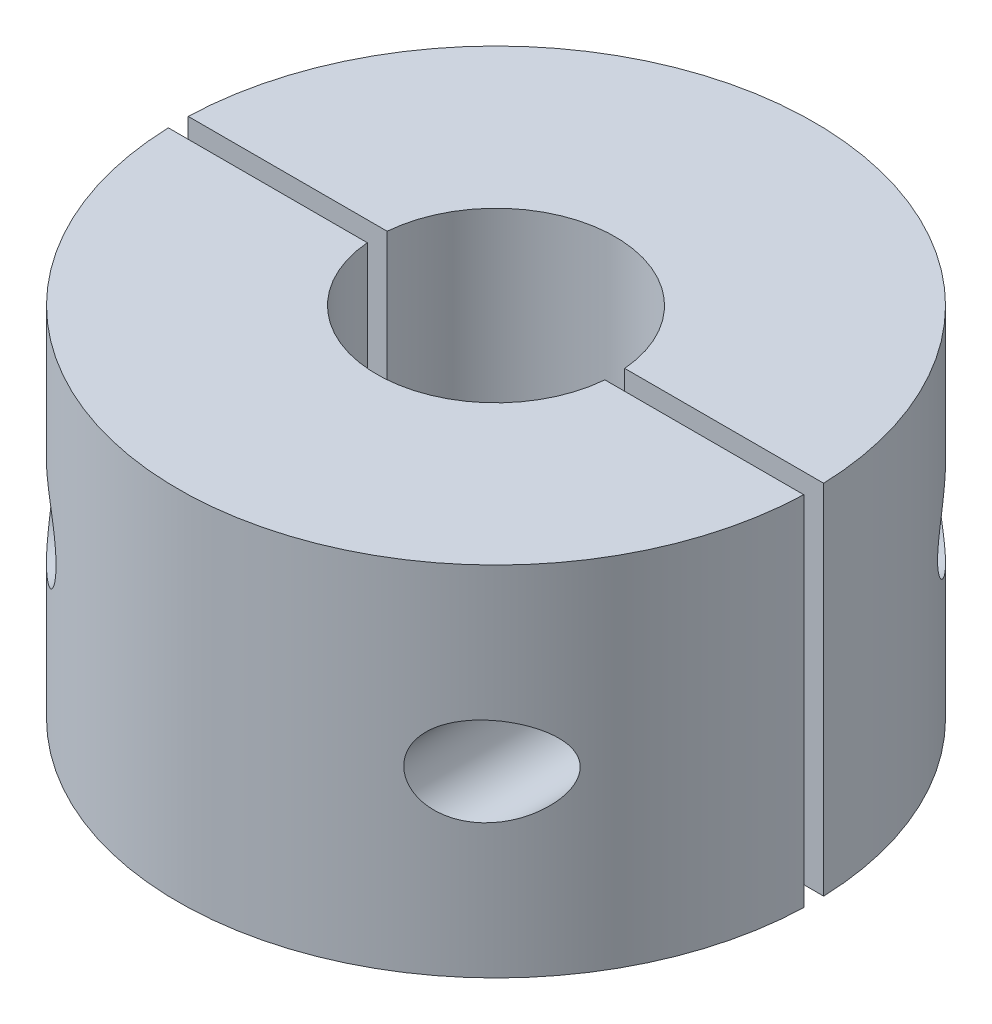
ISO-10303-21;
HEADER;
FILE_DESCRIPTION(('STEP AP214'),'2;1');
FILE_NAME('part.step','',(''),(''),'','','');
FILE_SCHEMA(('AUTOMOTIVE_DESIGN { 1 0 10303 214 1 1 1 1 }'));
ENDSEC;
DATA;
#1=APPLICATION_CONTEXT('core data for automotive mechanical design processes');
#2=APPLICATION_PROTOCOL_DEFINITION('international standard','automotive_design',2000,#1);
#3=PRODUCT_CONTEXT('',#1,'mechanical');
#4=PRODUCT('Part','Part','',(#3));
#5=PRODUCT_RELATED_PRODUCT_CATEGORY('part','',(#4));
#6=PRODUCT_DEFINITION_FORMATION('','',#4);
#7=PRODUCT_DEFINITION_CONTEXT('part definition',#1,'design');
#8=PRODUCT_DEFINITION('design','',#6,#7);
#9=PRODUCT_DEFINITION_SHAPE('','',#8);
#10=(LENGTH_UNIT() NAMED_UNIT(*) SI_UNIT(.MILLI.,.METRE.));
#11=(NAMED_UNIT(*) PLANE_ANGLE_UNIT() SI_UNIT($,.RADIAN.));
#12=(NAMED_UNIT(*) SI_UNIT($,.STERADIAN.) SOLID_ANGLE_UNIT());
#13=UNCERTAINTY_MEASURE_WITH_UNIT(LENGTH_MEASURE(1.E-05),#10,'distance_accuracy_value','');
#14=(GEOMETRIC_REPRESENTATION_CONTEXT(3) GLOBAL_UNCERTAINTY_ASSIGNED_CONTEXT((#13)) GLOBAL_UNIT_ASSIGNED_CONTEXT((#10,
#11,#12)) REPRESENTATION_CONTEXT('',''));
#15=CARTESIAN_POINT('',(0.,0.,0.));
#16=DIRECTION('',(0.,0.,1.));
#17=DIRECTION('',(1.,0.,0.));
#18=AXIS2_PLACEMENT_3D('',#15,#16,#17);
#19=CARTESIAN_POINT('',(0.,9.,0.));
#20=DIRECTION('',(0.,1.,0.));
#21=DIRECTION('',(0.,0.,1.));
#22=AXIS2_PLACEMENT_3D('',#19,#20,#21);
#23=PLANE('',#22);
#24=DIRECTION('',(-1.,0.,0.));
#25=VECTOR('',#24,1.);
#26=CARTESIAN_POINT('',(-10.,9.,-0.25));
#27=LINE('',#26,#25);
#28=CARTESIAN_POINT('',(7.99609279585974,9.,-0.25));
#29=VERTEX_POINT('',#28);
#30=CARTESIAN_POINT('',(2.98956518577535,9.,-0.25));
#31=VERTEX_POINT('',#30);
#32=EDGE_CURVE('E58',#29,#31,#27,.T.);
#33=ORIENTED_EDGE('',*,*,#32,.F.);
#34=CARTESIAN_POINT('',(0.,9.,0.));
#35=DIRECTION('',(0.,1.,0.));
#36=DIRECTION('',(0.,0.,1.));
#37=AXIS2_PLACEMENT_3D('',#34,#35,#36);
#38=CIRCLE('',#37,8.);
#39=CARTESIAN_POINT('',(-7.99609279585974,9.,-0.25));
#40=VERTEX_POINT('',#39);
#41=EDGE_CURVE('E105',#29,#40,#38,.T.);
#42=ORIENTED_EDGE('',*,*,#41,.T.);
#43=CARTESIAN_POINT('',(-2.98956518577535,9.,-0.25));
#44=VERTEX_POINT('',#43);
#45=EDGE_CURVE('E12',#44,#40,#27,.T.);
#46=ORIENTED_EDGE('',*,*,#45,.F.);
#47=CARTESIAN_POINT('',(0.,9.,0.));
#48=DIRECTION('',(0.,1.,0.));
#49=DIRECTION('',(0.,0.,1.));
#50=AXIS2_PLACEMENT_3D('',#47,#48,#49);
#51=CIRCLE('',#50,3.);
#52=EDGE_CURVE('E108',#31,#44,#51,.T.);
#53=ORIENTED_EDGE('',*,*,#52,.F.);
#54=EDGE_LOOP('',(#33,#42,#46,#53));
#55=FACE_BOUND('',#54,.T.);
#56=ADVANCED_FACE('F51',(#55),#23,.T.);
#57=CARTESIAN_POINT('',(0.,9.,0.));
#58=DIRECTION('',(0.,-1.,0.));
#59=DIRECTION('',(0.,0.,-1.));
#60=AXIS2_PLACEMENT_3D('',#57,#58,#59);
#61=CYLINDRICAL_SURFACE('',#60,8.);
#62=CARTESIAN_POINT('',(6.61630374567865,4.5,-4.49716852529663));
#63=CARTESIAN_POINT('',(6.61630097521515,4.53782391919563,-4.49717311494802));
#64=CARTESIAN_POINT('',(6.61436852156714,4.57567931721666,-4.50001970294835));
#65=CARTESIAN_POINT('',(6.60682037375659,4.65022903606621,-4.51109366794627));
#66=CARTESIAN_POINT('',(6.60119869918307,4.68692137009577,-4.51932978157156));
#67=CARTESIAN_POINT('',(6.58499437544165,4.76683776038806,-4.54291719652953));
#68=CARTESIAN_POINT('',(6.57354518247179,4.80951732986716,-4.55950134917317));
#69=CARTESIAN_POINT('',(6.54670795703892,4.8910673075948,-4.59795231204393));
#70=CARTESIAN_POINT('',(6.53131248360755,4.92993032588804,-4.61982909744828));
#71=CARTESIAN_POINT('',(6.48849544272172,5.02332895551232,-4.67989272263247));
#72=CARTESIAN_POINT('',(6.45901892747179,5.07528843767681,-4.72058785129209));
#73=CARTESIAN_POINT('',(6.39489339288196,5.17109188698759,-4.80710537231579));
#74=CARTESIAN_POINT('',(6.36023166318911,5.21491530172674,-4.85294029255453));
#75=CARTESIAN_POINT('',(6.2948016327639,5.28660693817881,-4.93737613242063));
#76=CARTESIAN_POINT('',(6.264806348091,5.31587770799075,-4.9754047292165));
#77=CARTESIAN_POINT('',(6.20265775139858,5.37025503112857,-5.05267280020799));
#78=CARTESIAN_POINT('',(6.17050329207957,5.39535934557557,-5.091912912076));
#79=CARTESIAN_POINT('',(6.07113723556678,5.46474768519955,-5.21074984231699));
#80=CARTESIAN_POINT('',(6.0010278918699,5.5031018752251,-5.2914568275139));
#81=CARTESIAN_POINT('',(5.85215668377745,5.56527374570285,-5.45573029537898));
#82=CARTESIAN_POINT('',(5.77318421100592,5.58856387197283,-5.53930236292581));
#83=CARTESIAN_POINT('',(5.61007570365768,5.61746223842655,-5.70442450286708));
#84=CARTESIAN_POINT('',(5.52594561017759,5.62309044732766,-5.78597675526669));
#85=CARTESIAN_POINT('',(5.37059894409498,5.61534582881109,-5.93007092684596));
#86=CARTESIAN_POINT('',(5.29988493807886,5.60530687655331,-5.99333113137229));
#87=CARTESIAN_POINT('',(5.15832325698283,5.57055122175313,-6.11558630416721));
#88=CARTESIAN_POINT('',(5.08747584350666,5.54585211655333,-6.17458629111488));
#89=CARTESIAN_POINT('',(4.9631949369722,5.48720058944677,-6.27468510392));
#90=CARTESIAN_POINT('',(4.90924622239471,5.45630798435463,-6.3169315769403));
#91=CARTESIAN_POINT('',(4.80499949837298,5.38389852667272,-6.39658210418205));
#92=CARTESIAN_POINT('',(4.75469725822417,5.34239424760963,-6.43399181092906));
#93=CARTESIAN_POINT('',(4.66809618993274,5.25654950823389,-6.49701947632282));
#94=CARTESIAN_POINT('',(4.63086120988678,5.21383744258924,-6.52356345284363));
#95=CARTESIAN_POINT('',(4.56227479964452,5.12141942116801,-6.57171242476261));
#96=CARTESIAN_POINT('',(4.53092176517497,5.07171537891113,-6.5933187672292));
#97=CARTESIAN_POINT('',(4.47562729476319,4.96594447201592,-6.63097985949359));
#98=CARTESIAN_POINT('',(4.45173315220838,4.90983996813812,-6.6469992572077));
#99=CARTESIAN_POINT('',(4.41318246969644,4.79316271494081,-6.67265805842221));
#100=CARTESIAN_POINT('',(4.39852051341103,4.73259260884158,-6.68230120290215));
#101=CARTESIAN_POINT('',(4.38054186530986,4.61615400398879,-6.69409838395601));
#102=CARTESIAN_POINT('',(4.37613283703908,4.56052489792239,-6.69697393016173));
#103=CARTESIAN_POINT('',(4.37565207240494,4.44922568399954,-6.69728830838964));
#104=CARTESIAN_POINT('',(4.37957721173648,4.39355559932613,-6.69472917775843));
#105=CARTESIAN_POINT('',(4.39512435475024,4.28665980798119,-6.68453138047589));
#106=CARTESIAN_POINT('',(4.40635294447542,4.23535088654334,-6.67715226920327));
#107=CARTESIAN_POINT('',(4.43553205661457,4.13560407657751,-6.6578044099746));
#108=CARTESIAN_POINT('',(4.45348287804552,4.08716631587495,-6.64583545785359));
#109=CARTESIAN_POINT('',(4.49599569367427,3.99259370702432,-6.61715190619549));
#110=CARTESIAN_POINT('',(4.52076913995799,3.94660098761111,-6.60028437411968));
#111=CARTESIAN_POINT('',(4.5754955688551,3.8596761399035,-6.56246489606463));
#112=CARTESIAN_POINT('',(4.605450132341,3.81874556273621,-6.54151170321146));
#113=CARTESIAN_POINT('',(4.67285007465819,3.73830055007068,-6.49356258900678));
#114=CARTESIAN_POINT('',(4.71075506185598,3.69941637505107,-6.46615846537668));
#115=CARTESIAN_POINT('',(4.79005863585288,3.62866850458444,-6.40763425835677));
#116=CARTESIAN_POINT('',(4.83145948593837,3.59680940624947,-6.37651176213));
#117=CARTESIAN_POINT('',(4.93517301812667,3.52755454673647,-6.29682322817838));
#118=CARTESIAN_POINT('',(4.9986924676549,3.49386042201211,-6.24659405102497));
#119=CARTESIAN_POINT('',(5.12745093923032,3.43987209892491,-6.14135250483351));
#120=CARTESIAN_POINT('',(5.19269303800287,3.4196038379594,-6.08633110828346));
#121=CARTESIAN_POINT('',(5.341279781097,3.38725051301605,-5.95675806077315));
#122=CARTESIAN_POINT('',(5.42451047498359,3.37911685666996,-5.88109323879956));
#123=CARTESIAN_POINT('',(5.58757807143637,3.38054964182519,-5.72640028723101));
#124=CARTESIAN_POINT('',(5.66741124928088,3.39013502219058,-5.64736864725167));
#125=CARTESIAN_POINT('',(5.82317969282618,3.42558384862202,-5.48664783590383));
#126=CARTESIAN_POINT('',(5.89903241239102,3.45170465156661,-5.40493638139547));
#127=CARTESIAN_POINT('',(6.04411756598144,3.51971037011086,-5.24218382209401));
#128=CARTESIAN_POINT('',(6.11335331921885,3.56158732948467,-5.16114240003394));
#129=CARTESIAN_POINT('',(6.22629776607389,3.64835411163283,-5.02383365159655));
#130=CARTESIAN_POINT('',(6.27189242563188,3.68946744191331,-4.96671931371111));
#131=CARTESIAN_POINT('',(6.35773057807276,3.78138606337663,-4.8563465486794));
#132=CARTESIAN_POINT('',(6.39798332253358,3.83217421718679,-4.80308152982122));
#133=CARTESIAN_POINT('',(6.45842525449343,3.92495419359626,-4.72126682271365));
#134=CARTESIAN_POINT('',(6.48068582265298,3.96373803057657,-4.69062251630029));
#135=CARTESIAN_POINT('',(6.52137757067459,4.04637231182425,-4.63388002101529));
#136=CARTESIAN_POINT('',(6.5398139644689,4.09021572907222,-4.60777565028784));
#137=CARTESIAN_POINT('',(6.5677413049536,4.17164811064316,-4.56784625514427));
#138=CARTESIAN_POINT('',(6.57831729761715,4.20814912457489,-4.55257933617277));
#139=CARTESIAN_POINT('',(6.59589359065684,4.28366198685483,-4.5270774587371));
#140=CARTESIAN_POINT('',(6.60290288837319,4.32266723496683,-4.51682984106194));
#141=CARTESIAN_POINT('',(6.61062136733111,4.38502830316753,-4.50551978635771));
#142=CARTESIAN_POINT('',(6.61274426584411,4.40785249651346,-4.50240157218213));
#143=CARTESIAN_POINT('',(6.61558641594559,4.45378051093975,-4.49822437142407));
#144=CARTESIAN_POINT('',(6.61630543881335,4.4768843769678,-4.49716572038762));
#145=CARTESIAN_POINT('',(6.61630374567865,4.5,-4.49716852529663));
#146=B_SPLINE_CURVE_WITH_KNOTS('',3,(#62,#63,#64,#65,#66,#67,#68,#69,#70,#71,#72,#73,#74,#75,
#76,#77,#78,#79,#80,#81,#82,#83,#84,#85,#86,#87,#88,#89,#90,#91,#92,#93,#94,#95,#96,#97,#98,#99,
#100,#101,#102,#103,#104,#105,#106,#107,#108,#109,#110,#111,#112,#113,#114,#115,#116,#117,#118,
#119,#120,#121,#122,#123,#124,#125,#126,#127,#128,#129,#130,#131,#132,#133,#134,#135,#136,#137,
#138,#139,#140,#141,#142,#143,#144,#145),.UNSPECIFIED.,.T.,.F.,(4,2,2,2,2,2,2,2,2,2,2,2,2,2,2,2,
2,2,2,2,2,2,2,2,2,2,2,2,2,2,2,2,2,2,2,2,2,2,2,2,2,4),(0.,0.113378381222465,0.226941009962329,
0.367744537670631,0.508815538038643,0.724465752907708,0.940653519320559,1.11020684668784,
1.27985099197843,1.61916788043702,1.9698030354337,2.32004161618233,2.60525189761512,
2.89012051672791,3.11476988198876,3.33915428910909,3.52610360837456,3.71300186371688,
3.90106215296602,4.08901200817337,4.25578106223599,4.42248760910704,4.58088442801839,
4.73928829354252,4.90329704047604,5.06735591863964,5.24913160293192,5.4310258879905,
5.69270942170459,5.95489703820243,6.29144769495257,6.62835827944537,6.97064596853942,
7.31276104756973,7.56371098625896,7.81422047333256,7.97644441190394,8.13844569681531,
8.26087830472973,8.38300051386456,8.45227903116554,8.52156883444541),.UNSPECIFIED.);
#147=CARTESIAN_POINT('',(6.61630374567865,4.5,-4.49716852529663));
#148=VERTEX_POINT('',#147);
#149=EDGE_CURVE('E111',#148,#148,#146,.T.);
#150=ORIENTED_EDGE('',*,*,#149,.T.);
#151=EDGE_LOOP('',(#150));
#152=FACE_BOUND('',#151,.T.);
#153=CARTESIAN_POINT('',(-4.37588184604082,4.5,-6.69713805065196));
#154=CARTESIAN_POINT('',(-4.37588540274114,4.55489865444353,-6.69713640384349));
#155=CARTESIAN_POINT('',(-4.37994362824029,4.60985732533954,-6.69448953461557));
#156=CARTESIAN_POINT('',(-4.39596122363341,4.71815182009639,-6.68398175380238));
#157=CARTESIAN_POINT('',(-4.40793403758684,4.77148472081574,-6.67611197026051));
#158=CARTESIAN_POINT('',(-4.43906754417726,4.87479377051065,-6.65545069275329));
#159=CARTESIAN_POINT('',(-4.4582045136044,4.92478036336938,-6.64267543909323));
#160=CARTESIAN_POINT('',(-4.50269218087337,5.02039459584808,-6.61260013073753));
#161=CARTESIAN_POINT('',(-4.52804194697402,5.06602288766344,-6.59530075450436));
#162=CARTESIAN_POINT('',(-4.58515834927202,5.15418632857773,-6.55572896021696));
#163=CARTESIAN_POINT('',(-4.6171729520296,5.19647093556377,-6.53325905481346));
#164=CARTESIAN_POINT('',(-4.68546428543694,5.27489463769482,-6.4844573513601));
#165=CARTESIAN_POINT('',(-4.72174256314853,5.31103149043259,-6.45812415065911));
#166=CARTESIAN_POINT('',(-4.8028551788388,5.38181507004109,-6.39808378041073));
#167=CARTESIAN_POINT('',(-4.84816577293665,5.41547619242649,-6.3638612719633));
#168=CARTESIAN_POINT('',(-4.94120618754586,5.47469037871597,-6.29189617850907));
#169=CARTESIAN_POINT('',(-4.98893795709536,5.50023678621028,-6.25415073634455));
#170=CARTESIAN_POINT('',(-5.10944584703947,5.55434140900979,-6.1564719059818));
#171=CARTESIAN_POINT('',(-5.18294869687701,5.5781563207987,-6.09478680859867));
#172=CARTESIAN_POINT('',(-5.3295264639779,5.61030621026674,-5.96704830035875));
#173=CARTESIAN_POINT('',(-5.40260042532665,5.61861443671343,-5.90098754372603));
#174=CARTESIAN_POINT('',(-5.56400769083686,5.62173122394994,-5.74950937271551));
#175=CARTESIAN_POINT('',(-5.65168490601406,5.61272652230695,-5.66332017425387));
#176=CARTESIAN_POINT('',(-5.82117625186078,5.57552423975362,-5.48896465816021));
#177=CARTESIAN_POINT('',(-5.90297514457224,5.54727863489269,-5.40079392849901));
#178=CARTESIAN_POINT('',(-6.02021949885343,5.49099212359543,-5.26882339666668));
#179=CARTESIAN_POINT('',(-6.05859868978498,5.46974544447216,-5.2246248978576));
#180=CARTESIAN_POINT('',(-6.13313701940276,5.42249391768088,-5.1369184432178));
#181=CARTESIAN_POINT('',(-6.16929733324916,5.39649161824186,-5.09341013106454));
#182=CARTESIAN_POINT('',(-6.23899305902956,5.3396355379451,-5.0077942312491));
#183=CARTESIAN_POINT('',(-6.27253758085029,5.30879983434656,-4.96568210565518));
#184=CARTESIAN_POINT('',(-6.33671405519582,5.24187347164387,-4.88351954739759));
#185=CARTESIAN_POINT('',(-6.36734958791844,5.20578941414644,-4.84346660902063));
#186=CARTESIAN_POINT('',(-6.42118908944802,5.13310916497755,-4.77179836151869));
#187=CARTESIAN_POINT('',(-6.44483721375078,5.0972489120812,-4.73977608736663));
#188=CARTESIAN_POINT('',(-6.48887291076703,5.02077290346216,-4.67930786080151));
#189=CARTESIAN_POINT('',(-6.509262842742,4.98016062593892,-4.65085932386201));
#190=CARTESIAN_POINT('',(-6.54299293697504,4.90055136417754,-4.60325552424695));
#191=CARTESIAN_POINT('',(-6.55693536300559,4.86227116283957,-4.58334366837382));
#192=CARTESIAN_POINT('',(-6.58095963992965,4.78226079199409,-4.54878176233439));
#193=CARTESIAN_POINT('',(-6.59104817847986,4.74053675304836,-4.53412259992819));
#194=CARTESIAN_POINT('',(-6.60498590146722,4.66271606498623,-4.51378824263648));
#195=CARTESIAN_POINT('',(-6.60966217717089,4.62708165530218,-4.50692704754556));
#196=CARTESIAN_POINT('',(-6.61554030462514,4.55492346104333,-4.4982947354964));
#197=CARTESIAN_POINT('',(-6.61674487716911,4.51840039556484,-4.49651963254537));
#198=CARTESIAN_POINT('',(-6.61557215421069,4.4455243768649,-4.4982447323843));
#199=CARTESIAN_POINT('',(-6.6131932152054,4.40917150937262,-4.50174735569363));
#200=CARTESIAN_POINT('',(-6.60506524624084,4.33766871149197,-4.51366407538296));
#201=CARTESIAN_POINT('',(-6.59931327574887,4.3025198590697,-4.52208245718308));
#202=CARTESIAN_POINT('',(-6.58267623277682,4.22381311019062,-4.54627824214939));
#203=CARTESIAN_POINT('',(-6.57076518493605,4.18092434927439,-4.56351080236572));
#204=CARTESIAN_POINT('',(-6.54299100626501,4.0990558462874,-4.60324427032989));
#205=CARTESIAN_POINT('',(-6.52711940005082,4.06008474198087,-4.62575646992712));
#206=CARTESIAN_POINT('',(-6.48290333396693,3.96610066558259,-4.68765080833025));
#207=CARTESIAN_POINT('',(-6.4524499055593,3.91377907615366,-4.72958100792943));
#208=CARTESIAN_POINT('',(-6.38629490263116,3.8174776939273,-4.81854089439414));
#209=CARTESIAN_POINT('',(-6.35058050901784,3.77351889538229,-4.86558296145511));
#210=CARTESIAN_POINT('',(-6.28339405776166,3.7019578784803,-4.95189466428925));
#211=CARTESIAN_POINT('',(-6.25272369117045,3.67288650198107,-4.9905901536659));
#212=CARTESIAN_POINT('',(-6.18920957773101,3.61897943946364,-5.06914625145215));
#213=CARTESIAN_POINT('',(-6.1563646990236,3.59414598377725,-5.1090074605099));
#214=CARTESIAN_POINT('',(-6.05490165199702,3.52569175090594,-5.22964281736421));
#215=CARTESIAN_POINT('',(-5.98335822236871,3.48812035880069,-5.31146460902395));
#216=CARTESIAN_POINT('',(-5.83172301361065,3.42805171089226,-5.47759787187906));
#217=CARTESIAN_POINT('',(-5.75143625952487,3.40605251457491,-5.56190867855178));
#218=CARTESIAN_POINT('',(-5.58576367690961,3.38025025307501,-5.72825951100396));
#219=CARTESIAN_POINT('',(-5.5003843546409,3.37642445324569,-5.81030224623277));
#220=CARTESIAN_POINT('',(-5.34476837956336,3.38791149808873,-5.95333810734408));
#221=CARTESIAN_POINT('',(-5.27503789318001,3.39944203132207,-6.01518435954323));
#222=CARTESIAN_POINT('',(-5.13570375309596,3.436900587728,-6.13456701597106));
#223=CARTESIAN_POINT('',(-5.06610004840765,3.46281104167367,-6.19210858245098));
#224=CARTESIAN_POINT('',(-4.94402582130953,3.52341181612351,-6.28978612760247));
#225=CARTESIAN_POINT('',(-4.89100232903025,3.55515593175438,-6.33105332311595));
#226=CARTESIAN_POINT('',(-4.78877026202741,3.62906257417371,-6.40872699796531));
#227=CARTESIAN_POINT('',(-4.73955713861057,3.67121241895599,-6.44513931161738));
#228=CARTESIAN_POINT('',(-4.65495451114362,3.75810448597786,-6.5064332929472));
#229=CARTESIAN_POINT('',(-4.61862236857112,3.80128227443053,-6.53222649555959));
#230=CARTESIAN_POINT('',(-4.55191665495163,3.89445775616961,-6.57888383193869));
#231=CARTESIAN_POINT('',(-4.52154371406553,3.94445616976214,-6.59974744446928));
#232=CARTESIAN_POINT('',(-4.46824610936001,4.05060520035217,-6.63594970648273));
#233=CARTESIAN_POINT('',(-4.44537326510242,4.10679517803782,-6.65124999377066));
#234=CARTESIAN_POINT('',(-4.40888106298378,4.22332402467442,-6.67549680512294));
#235=CARTESIAN_POINT('',(-4.39523913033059,4.28365237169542,-6.68445883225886));
#236=CARTESIAN_POINT('',(-4.3830858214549,4.37052869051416,-6.69242647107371));
#237=CARTESIAN_POINT('',(-4.38038908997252,4.39631301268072,-6.69419120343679));
#238=CARTESIAN_POINT('',(-4.37678628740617,4.44806041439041,-6.69654736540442));
#239=CARTESIAN_POINT('',(-4.37588016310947,4.47402348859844,-6.69713882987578));
#240=CARTESIAN_POINT('',(-4.37588184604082,4.5,-6.69713805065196));
#241=B_SPLINE_CURVE_WITH_KNOTS('',3,(#153,#154,#155,#156,#157,#158,#159,#160,#161,#162,#163,
#164,#165,#166,#167,#168,#169,#170,#171,#172,#173,#174,#175,#176,#177,#178,#179,#180,#181,#182,
#183,#184,#185,#186,#187,#188,#189,#190,#191,#192,#193,#194,#195,#196,#197,#198,#199,#200,#201,
#202,#203,#204,#205,#206,#207,#208,#209,#210,#211,#212,#213,#214,#215,#216,#217,#218,#219,#220,
#221,#222,#223,#224,#225,#226,#227,#228,#229,#230,#231,#232,#233,#234,#235,#236,#237,#238,#239,
#240),.UNSPECIFIED.,.T.,.F.,(4,2,2,2,2,2,2,2,2,2,2,2,2,2,2,2,2,2,2,2,2,2,2,2,2,2,2,2,2,2,2,2,2,
2,2,2,2,2,2,2,2,2,2,4),(0.,0.164591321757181,0.329462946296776,0.49379337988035,
0.658099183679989,0.830224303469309,1.00241207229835,1.19970710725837,1.39716356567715,
1.69213591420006,1.98761666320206,2.35561029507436,2.72452579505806,2.91116502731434,
3.09770454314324,3.28356234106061,3.46918834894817,3.62958939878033,3.78987377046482,
3.92543939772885,4.06076869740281,4.17005520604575,4.27925604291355,4.38850697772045,
4.49785329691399,4.64024735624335,4.78294878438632,5.00265426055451,5.22290421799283,
5.39457598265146,5.56633781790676,5.90987956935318,6.2639655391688,6.61760843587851,
6.89835856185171,7.17876642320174,7.40086374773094,7.62269171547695,7.80806400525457,
7.99345588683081,8.18010293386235,8.36629185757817,8.44417419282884,8.52205421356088),.UNSPECIFIED.);
#242=CARTESIAN_POINT('',(-4.37588184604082,4.5,-6.69713805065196));
#243=VERTEX_POINT('',#242);
#244=EDGE_CURVE('E124',#243,#243,#241,.T.);
#245=ORIENTED_EDGE('',*,*,#244,.T.);
#246=EDGE_LOOP('',(#245));
#247=FACE_BOUND('',#246,.T.);
#248=ORIENTED_EDGE('',*,*,#41,.F.);
#249=DIRECTION('',(0.,-1.,0.));
#250=VECTOR('',#249,1.);
#251=CARTESIAN_POINT('',(7.99609279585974,9.,-0.25));
#252=LINE('',#251,#250);
#253=CARTESIAN_POINT('',(7.99609279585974,0.,-0.25));
#254=VERTEX_POINT('',#253);
#255=EDGE_CURVE('E93',#29,#254,#252,.T.);
#256=ORIENTED_EDGE('',*,*,#255,.T.);
#257=CARTESIAN_POINT('',(0.,0.,0.));
#258=DIRECTION('',(0.,1.,0.));
#259=DIRECTION('',(0.,0.,1.));
#260=AXIS2_PLACEMENT_3D('',#257,#258,#259);
#261=CIRCLE('',#260,8.);
#262=CARTESIAN_POINT('',(-7.99609279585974,0.,-0.25));
#263=VERTEX_POINT('',#262);
#264=EDGE_CURVE('E103',#254,#263,#261,.T.);
#265=ORIENTED_EDGE('',*,*,#264,.T.);
#266=DIRECTION('',(0.,-1.,0.));
#267=VECTOR('',#266,1.);
#268=CARTESIAN_POINT('',(-7.99609279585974,9.,-0.25));
#269=LINE('',#268,#267);
#270=EDGE_CURVE('E66',#263,#40,#269,.F.);
#271=ORIENTED_EDGE('',*,*,#270,.T.);
#272=EDGE_LOOP('',(#248,#256,#265,#271));
#273=FACE_BOUND('',#272,.T.);
#274=ADVANCED_FACE('F109',(#152,#247,#273),#61,.T.);
#275=CARTESIAN_POINT('',(0.,0.,0.));
#276=DIRECTION('',(0.,1.,0.));
#277=DIRECTION('',(0.,0.,1.));
#278=AXIS2_PLACEMENT_3D('',#275,#276,#277);
#279=PLANE('',#278);
#280=ORIENTED_EDGE('',*,*,#264,.F.);
#281=DIRECTION('',(-1.,0.,0.));
#282=VECTOR('',#281,1.);
#283=CARTESIAN_POINT('',(-10.,0.,-0.25));
#284=LINE('',#283,#282);
#285=CARTESIAN_POINT('',(2.98956518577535,0.,-0.25));
#286=VERTEX_POINT('',#285);
#287=EDGE_CURVE('E98',#254,#286,#284,.T.);
#288=ORIENTED_EDGE('',*,*,#287,.T.);
#289=CARTESIAN_POINT('',(0.,0.,0.));
#290=DIRECTION('',(0.,1.,0.));
#291=DIRECTION('',(0.,0.,1.));
#292=AXIS2_PLACEMENT_3D('',#289,#290,#291);
#293=CIRCLE('',#292,3.);
#294=CARTESIAN_POINT('',(-2.98956518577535,0.,-0.25));
#295=VERTEX_POINT('',#294);
#296=EDGE_CURVE('E117',#286,#295,#293,.T.);
#297=ORIENTED_EDGE('',*,*,#296,.T.);
#298=EDGE_CURVE('E88',#295,#263,#284,.T.);
#299=ORIENTED_EDGE('',*,*,#298,.T.);
#300=EDGE_LOOP('',(#280,#288,#297,#299));
#301=FACE_BOUND('',#300,.T.);
#302=ADVANCED_FACE('F154',(#301),#279,.F.);
#303=CARTESIAN_POINT('',(0.,0.,0.));
#304=DIRECTION('',(0.,1.,0.));
#305=DIRECTION('',(0.,0.,1.));
#306=AXIS2_PLACEMENT_3D('',#303,#304,#305);
#307=CYLINDRICAL_SURFACE('',#306,3.);
#308=ORIENTED_EDGE('',*,*,#52,.T.);
#309=DIRECTION('',(0.,1.,0.));
#310=VECTOR('',#309,1.);
#311=CARTESIAN_POINT('',(-2.98956518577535,0.,-0.25));
#312=LINE('',#311,#310);
#313=EDGE_CURVE('E81',#44,#295,#312,.F.);
#314=ORIENTED_EDGE('',*,*,#313,.T.);
#315=ORIENTED_EDGE('',*,*,#296,.F.);
#316=DIRECTION('',(0.,1.,0.));
#317=VECTOR('',#316,1.);
#318=CARTESIAN_POINT('',(2.98956518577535,0.,-0.25));
#319=LINE('',#318,#317);
#320=EDGE_CURVE('E107',#286,#31,#319,.T.);
#321=ORIENTED_EDGE('',*,*,#320,.T.);
#322=EDGE_LOOP('',(#308,#314,#315,#321));
#323=FACE_BOUND('',#322,.T.);
#324=ADVANCED_FACE('F155',(#323),#307,.F.);
#325=CARTESIAN_POINT('',(-10.,0.,-0.25));
#326=DIRECTION('',(0.,0.,-1.));
#327=DIRECTION('',(-1.,0.,0.));
#328=AXIS2_PLACEMENT_3D('',#325,#326,#327);
#329=PLANE('',#328);
#330=CARTESIAN_POINT('',(5.49609279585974,4.5,-0.25));
#331=DIRECTION('',(0.,0.,-1.));
#332=DIRECTION('',(-1.,0.,0.));
#333=AXIS2_PLACEMENT_3D('',#330,#331,#332);
#334=CIRCLE('',#333,1.12021094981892);
#335=CARTESIAN_POINT('',(4.37588184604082,4.5,-0.25));
#336=VERTEX_POINT('',#335);
#337=EDGE_CURVE('E53',#336,#336,#334,.T.);
#338=ORIENTED_EDGE('',*,*,#337,.T.);
#339=EDGE_LOOP('',(#338));
#340=FACE_BOUND('',#339,.T.);
#341=ORIENTED_EDGE('',*,*,#32,.T.);
#342=ORIENTED_EDGE('',*,*,#320,.F.);
#343=ORIENTED_EDGE('',*,*,#287,.F.);
#344=ORIENTED_EDGE('',*,*,#255,.F.);
#345=EDGE_LOOP('',(#341,#342,#343,#344));
#346=FACE_BOUND('',#345,.T.);
#347=ADVANCED_FACE('F92',(#340,#346),#329,.F.);
#348=CARTESIAN_POINT('',(-5.49609279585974,4.5,-0.25));
#349=DIRECTION('',(0.,0.,-1.));
#350=DIRECTION('',(-1.,0.,0.));
#351=AXIS2_PLACEMENT_3D('',#348,#349,#350);
#352=CIRCLE('',#351,1.12021094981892);
#353=CARTESIAN_POINT('',(-6.61630374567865,4.5,-0.25));
#354=VERTEX_POINT('',#353);
#355=EDGE_CURVE('E122',#354,#354,#352,.T.);
#356=ORIENTED_EDGE('',*,*,#355,.T.);
#357=EDGE_LOOP('',(#356));
#358=FACE_BOUND('',#357,.T.);
#359=ORIENTED_EDGE('',*,*,#298,.F.);
#360=ORIENTED_EDGE('',*,*,#313,.F.);
#361=ORIENTED_EDGE('',*,*,#45,.T.);
#362=ORIENTED_EDGE('',*,*,#270,.F.);
#363=EDGE_LOOP('',(#359,#360,#361,#362));
#364=FACE_BOUND('',#363,.T.);
#365=ADVANCED_FACE('F149',(#358,#364),#329,.F.);
#366=CARTESIAN_POINT('',(-5.49609279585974,4.5,-8.));
#367=DIRECTION('',(0.,0.,1.));
#368=DIRECTION('',(1.,0.,0.));
#369=AXIS2_PLACEMENT_3D('',#366,#367,#368);
#370=CYLINDRICAL_SURFACE('',#369,1.12021094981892);
#371=ORIENTED_EDGE('',*,*,#355,.F.);
#372=EDGE_LOOP('',(#371));
#373=FACE_BOUND('',#372,.T.);
#374=ORIENTED_EDGE('',*,*,#244,.F.);
#375=EDGE_LOOP('',(#374));
#376=FACE_BOUND('',#375,.T.);
#377=ADVANCED_FACE('F141',(#373,#376),#370,.F.);
#378=CARTESIAN_POINT('',(5.49609279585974,4.5,-8.));
#379=DIRECTION('',(0.,0.,1.));
#380=DIRECTION('',(1.,0.,0.));
#381=AXIS2_PLACEMENT_3D('',#378,#379,#380);
#382=CYLINDRICAL_SURFACE('',#381,1.12021094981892);
#383=ORIENTED_EDGE('',*,*,#337,.F.);
#384=EDGE_LOOP('',(#383));
#385=FACE_BOUND('',#384,.T.);
#386=ORIENTED_EDGE('',*,*,#149,.F.);
#387=EDGE_LOOP('',(#386));
#388=FACE_BOUND('',#387,.T.);
#389=ADVANCED_FACE('F150',(#385,#388),#382,.F.);
#390=CLOSED_SHELL('',(#56,#274,#302,#324,#347,#365,#377,#389));
#391=MANIFOLD_SOLID_BREP('B2',#390);
#392=CARTESIAN_POINT('',(0.,0.,0.));
#393=DIRECTION('',(0.,1.,0.));
#394=DIRECTION('',(0.,0.,1.));
#395=AXIS2_PLACEMENT_3D('',#392,#393,#394);
#396=CYLINDRICAL_SURFACE('',#395,3.);
#397=CARTESIAN_POINT('',(0.,9.,0.));
#398=DIRECTION('',(0.,1.,0.));
#399=DIRECTION('',(0.,0.,1.));
#400=AXIS2_PLACEMENT_3D('',#397,#398,#399);
#401=CIRCLE('',#400,3.);
#402=CARTESIAN_POINT('',(-2.98956518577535,9.,0.25));
#403=VERTEX_POINT('',#402);
#404=CARTESIAN_POINT('',(2.98956518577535,9.,0.25));
#405=VERTEX_POINT('',#404);
#406=EDGE_CURVE('E271',#403,#405,#401,.T.);
#407=ORIENTED_EDGE('',*,*,#406,.T.);
#408=DIRECTION('',(0.,1.,0.));
#409=VECTOR('',#408,1.);
#410=CARTESIAN_POINT('',(2.98956518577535,0.,0.25));
#411=LINE('',#410,#409);
#412=CARTESIAN_POINT('',(2.98956518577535,0.,0.25));
#413=VERTEX_POINT('',#412);
#414=EDGE_CURVE('E47',#405,#413,#411,.F.);
#415=ORIENTED_EDGE('',*,*,#414,.T.);
#416=CARTESIAN_POINT('',(0.,0.,0.));
#417=DIRECTION('',(0.,1.,0.));
#418=DIRECTION('',(0.,0.,1.));
#419=AXIS2_PLACEMENT_3D('',#416,#417,#418);
#420=CIRCLE('',#419,3.);
#421=CARTESIAN_POINT('',(-2.98956518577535,0.,0.25));
#422=VERTEX_POINT('',#421);
#423=EDGE_CURVE('E290',#422,#413,#420,.T.);
#424=ORIENTED_EDGE('',*,*,#423,.F.);
#425=DIRECTION('',(0.,1.,0.));
#426=VECTOR('',#425,1.);
#427=CARTESIAN_POINT('',(-2.98956518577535,0.,0.25));
#428=LINE('',#427,#426);
#429=EDGE_CURVE('E234',#422,#403,#428,.T.);
#430=ORIENTED_EDGE('',*,*,#429,.T.);
#431=EDGE_LOOP('',(#407,#415,#424,#430));
#432=FACE_BOUND('',#431,.T.);
#433=ADVANCED_FACE('F225',(#432),#396,.F.);
#434=CARTESIAN_POINT('',(0.,9.,0.));
#435=DIRECTION('',(0.,-1.,0.));
#436=DIRECTION('',(0.,0.,-1.));
#437=AXIS2_PLACEMENT_3D('',#434,#435,#436);
#438=CYLINDRICAL_SURFACE('',#437,8.);
#439=CARTESIAN_POINT('',(6.61630374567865,4.5,4.49716852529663));
#440=CARTESIAN_POINT('',(6.61630097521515,4.46217608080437,4.49717311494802));
#441=CARTESIAN_POINT('',(6.61436852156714,4.42432068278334,4.50001970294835));
#442=CARTESIAN_POINT('',(6.60682037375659,4.34977096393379,4.51109366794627));
#443=CARTESIAN_POINT('',(6.60119869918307,4.31307862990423,4.51932978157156));
#444=CARTESIAN_POINT('',(6.58499437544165,4.23316223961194,4.54291719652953));
#445=CARTESIAN_POINT('',(6.57354518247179,4.19048267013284,4.55950134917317));
#446=CARTESIAN_POINT('',(6.54670795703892,4.10893269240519,4.59795231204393));
#447=CARTESIAN_POINT('',(6.53131248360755,4.07006967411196,4.61982909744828));
#448=CARTESIAN_POINT('',(6.48849544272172,3.97667104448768,4.67989272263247));
#449=CARTESIAN_POINT('',(6.45901892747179,3.92471156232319,4.72058785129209));
#450=CARTESIAN_POINT('',(6.39489339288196,3.82890811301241,4.80710537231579));
#451=CARTESIAN_POINT('',(6.36023166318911,3.78508469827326,4.85294029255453));
#452=CARTESIAN_POINT('',(6.2948016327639,3.71339306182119,4.93737613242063));
#453=CARTESIAN_POINT('',(6.264806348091,3.68412229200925,4.9754047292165));
#454=CARTESIAN_POINT('',(6.20265775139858,3.62974496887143,5.05267280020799));
#455=CARTESIAN_POINT('',(6.17050329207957,3.60464065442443,5.091912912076));
#456=CARTESIAN_POINT('',(6.07113723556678,3.53525231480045,5.21074984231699));
#457=CARTESIAN_POINT('',(6.0010278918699,3.4968981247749,5.2914568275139));
#458=CARTESIAN_POINT('',(5.85215668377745,3.43472625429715,5.45573029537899));
#459=CARTESIAN_POINT('',(5.77318421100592,3.41143612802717,5.53930236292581));
#460=CARTESIAN_POINT('',(5.61007570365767,3.38253776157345,5.70442450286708));
#461=CARTESIAN_POINT('',(5.52594561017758,3.37690955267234,5.78597675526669));
#462=CARTESIAN_POINT('',(5.37059894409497,3.38465417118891,5.93007092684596));
#463=CARTESIAN_POINT('',(5.29988493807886,3.39469312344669,5.99333113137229));
#464=CARTESIAN_POINT('',(5.15832325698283,3.42944877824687,6.11558630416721));
#465=CARTESIAN_POINT('',(5.08747584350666,3.45414788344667,6.17458629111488));
#466=CARTESIAN_POINT('',(4.96319493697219,3.51279941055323,6.27468510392));
#467=CARTESIAN_POINT('',(4.90924622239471,3.54369201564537,6.3169315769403));
#468=CARTESIAN_POINT('',(4.80499949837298,3.61610147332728,6.39658210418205));
#469=CARTESIAN_POINT('',(4.75469725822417,3.65760575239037,6.43399181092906));
#470=CARTESIAN_POINT('',(4.66809618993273,3.74345049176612,6.49701947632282));
#471=CARTESIAN_POINT('',(4.63086120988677,3.78616255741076,6.52356345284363));
#472=CARTESIAN_POINT('',(4.56227479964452,3.878580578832,6.57171242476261));
#473=CARTESIAN_POINT('',(4.53092176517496,3.92828462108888,6.5933187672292));
#474=CARTESIAN_POINT('',(4.47562729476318,4.03405552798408,6.63097985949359));
#475=CARTESIAN_POINT('',(4.45173315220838,4.09016003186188,6.6469992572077));
#476=CARTESIAN_POINT('',(4.41318246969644,4.2068372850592,6.67265805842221));
#477=CARTESIAN_POINT('',(4.39852051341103,4.26740739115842,6.68230120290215));
#478=CARTESIAN_POINT('',(4.38054186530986,4.38384599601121,6.69409838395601));
#479=CARTESIAN_POINT('',(4.37613283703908,4.43947510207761,6.69697393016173));
#480=CARTESIAN_POINT('',(4.37565207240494,4.55077431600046,6.69728830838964));
#481=CARTESIAN_POINT('',(4.37957721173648,4.60644440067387,6.69472917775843));
#482=CARTESIAN_POINT('',(4.39512435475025,4.71334019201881,6.68453138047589));
#483=CARTESIAN_POINT('',(4.40635294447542,4.76464911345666,6.67715226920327));
#484=CARTESIAN_POINT('',(4.43553205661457,4.86439592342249,6.6578044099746));
#485=CARTESIAN_POINT('',(4.45348287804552,4.91283368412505,6.64583545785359));
#486=CARTESIAN_POINT('',(4.49599569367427,5.00740629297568,6.61715190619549));
#487=CARTESIAN_POINT('',(4.52076913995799,5.05339901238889,6.60028437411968));
#488=CARTESIAN_POINT('',(4.5754955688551,5.1403238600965,6.56246489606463));
#489=CARTESIAN_POINT('',(4.60545013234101,5.18125443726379,6.54151170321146));
#490=CARTESIAN_POINT('',(4.67285007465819,5.26169944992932,6.49356258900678));
#491=CARTESIAN_POINT('',(4.71075506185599,5.30058362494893,6.46615846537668));
#492=CARTESIAN_POINT('',(4.79005863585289,5.37133149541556,6.40763425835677));
#493=CARTESIAN_POINT('',(4.83145948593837,5.40319059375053,6.37651176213));
#494=CARTESIAN_POINT('',(4.93517301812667,5.47244545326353,6.29682322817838));
#495=CARTESIAN_POINT('',(4.9986924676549,5.50613957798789,6.24659405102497));
#496=CARTESIAN_POINT('',(5.12745093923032,5.56012790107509,6.1413525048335));
#497=CARTESIAN_POINT('',(5.19269303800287,5.5803961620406,6.08633110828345));
#498=CARTESIAN_POINT('',(5.34127978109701,5.61274948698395,5.95675806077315));
#499=CARTESIAN_POINT('',(5.4245104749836,5.62088314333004,5.88109323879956));
#500=CARTESIAN_POINT('',(5.58757807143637,5.61945035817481,5.726400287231));
#501=CARTESIAN_POINT('',(5.66741124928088,5.60986497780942,5.64736864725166));
#502=CARTESIAN_POINT('',(5.82317969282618,5.57441615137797,5.48664783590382));
#503=CARTESIAN_POINT('',(5.89903241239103,5.54829534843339,5.40493638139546));
#504=CARTESIAN_POINT('',(6.04411756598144,5.48028962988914,5.242183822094));
#505=CARTESIAN_POINT('',(6.11335331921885,5.43841267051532,5.16114240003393));
#506=CARTESIAN_POINT('',(6.2262977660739,5.35164588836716,5.02383365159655));
#507=CARTESIAN_POINT('',(6.27189242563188,5.31053255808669,4.9667193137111));
#508=CARTESIAN_POINT('',(6.35773057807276,5.21861393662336,4.85634654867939));
#509=CARTESIAN_POINT('',(6.39798332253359,5.16782578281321,4.80308152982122));
#510=CARTESIAN_POINT('',(6.45842525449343,5.07504580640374,4.72126682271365));
#511=CARTESIAN_POINT('',(6.48068582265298,5.03626196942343,4.69062251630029));
#512=CARTESIAN_POINT('',(6.52137757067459,4.95362768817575,4.63388002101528));
#513=CARTESIAN_POINT('',(6.53981396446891,4.90978427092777,4.60777565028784));
#514=CARTESIAN_POINT('',(6.5677413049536,4.82835188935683,4.56784625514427));
#515=CARTESIAN_POINT('',(6.57831729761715,4.79185087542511,4.55257933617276));
#516=CARTESIAN_POINT('',(6.59589359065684,4.71633801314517,4.52707745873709));
#517=CARTESIAN_POINT('',(6.6029028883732,4.67733276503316,4.51682984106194));
#518=CARTESIAN_POINT('',(6.61062136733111,4.61497169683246,4.50551978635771));
#519=CARTESIAN_POINT('',(6.61274426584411,4.59214750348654,4.50240157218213));
#520=CARTESIAN_POINT('',(6.61558641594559,4.54621948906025,4.49822437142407));
#521=CARTESIAN_POINT('',(6.61630543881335,4.5231156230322,4.49716572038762));
#522=CARTESIAN_POINT('',(6.61630374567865,4.5,4.49716852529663));
#523=B_SPLINE_CURVE_WITH_KNOTS('',3,(#439,#440,#441,#442,#443,#444,#445,#446,#447,#448,#449,
#450,#451,#452,#453,#454,#455,#456,#457,#458,#459,#460,#461,#462,#463,#464,#465,#466,#467,#468,
#469,#470,#471,#472,#473,#474,#475,#476,#477,#478,#479,#480,#481,#482,#483,#484,#485,#486,#487,
#488,#489,#490,#491,#492,#493,#494,#495,#496,#497,#498,#499,#500,#501,#502,#503,#504,#505,#506,
#507,#508,#509,#510,#511,#512,#513,#514,#515,#516,#517,#518,#519,#520,#521,#522),.UNSPECIFIED.,
.T.,.F.,(4,2,2,2,2,2,2,2,2,2,2,2,2,2,2,2,2,2,2,2,2,2,2,2,2,2,2,2,2,2,2,2,2,2,2,2,2,2,2,2,2,4),
(0.,0.113378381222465,0.226941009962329,0.367744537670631,0.508815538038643,0.724465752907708,
0.940653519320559,1.11020684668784,1.27985099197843,1.61916788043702,1.96980303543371,
2.32004161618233,2.60525189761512,2.89012051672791,3.11476988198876,3.33915428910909,
3.52610360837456,3.71300186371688,3.90106215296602,4.08901200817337,4.25578106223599,
4.42248760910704,4.5808844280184,4.73928829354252,4.90329704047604,5.06735591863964,
5.24913160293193,5.43102588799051,5.6927094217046,5.95489703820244,6.29144769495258,
6.62835827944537,6.97064596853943,7.31276104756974,7.56371098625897,7.81422047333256,
7.97644441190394,8.13844569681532,8.26087830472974,8.38300051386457,8.45227903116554,
8.52156883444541),.UNSPECIFIED.);
#524=CARTESIAN_POINT('',(6.61630374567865,4.5,4.49716852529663));
#525=VERTEX_POINT('',#524);
#526=EDGE_CURVE('E294',#525,#525,#523,.T.);
#527=ORIENTED_EDGE('',*,*,#526,.T.);
#528=EDGE_LOOP('',(#527));
#529=FACE_BOUND('',#528,.T.);
#530=CARTESIAN_POINT('',(-4.37588184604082,4.5,6.69713805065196));
#531=CARTESIAN_POINT('',(-4.37588540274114,4.44510134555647,6.69713640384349));
#532=CARTESIAN_POINT('',(-4.37994362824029,4.39014267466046,6.69448953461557));
#533=CARTESIAN_POINT('',(-4.39596122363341,4.28184817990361,6.68398175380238));
#534=CARTESIAN_POINT('',(-4.40793403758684,4.22851527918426,6.67611197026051));
#535=CARTESIAN_POINT('',(-4.43906754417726,4.12520622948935,6.65545069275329));
#536=CARTESIAN_POINT('',(-4.4582045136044,4.07521963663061,6.64267543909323));
#537=CARTESIAN_POINT('',(-4.50269218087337,3.97960540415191,6.61260013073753));
#538=CARTESIAN_POINT('',(-4.52804194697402,3.93397711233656,6.59530075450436));
#539=CARTESIAN_POINT('',(-4.58515834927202,3.84581367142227,6.55572896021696));
#540=CARTESIAN_POINT('',(-4.6171729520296,3.80352906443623,6.53325905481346));
#541=CARTESIAN_POINT('',(-4.68546428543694,3.72510536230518,6.4844573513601));
#542=CARTESIAN_POINT('',(-4.72174256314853,3.68896850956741,6.45812415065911));
#543=CARTESIAN_POINT('',(-4.8028551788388,3.61818492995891,6.39808378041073));
#544=CARTESIAN_POINT('',(-4.84816577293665,3.58452380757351,6.3638612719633));
#545=CARTESIAN_POINT('',(-4.94120618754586,3.52530962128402,6.29189617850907));
#546=CARTESIAN_POINT('',(-4.98893795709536,3.49976321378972,6.25415073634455));
#547=CARTESIAN_POINT('',(-5.10944584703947,3.44565859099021,6.1564719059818));
#548=CARTESIAN_POINT('',(-5.18294869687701,3.4218436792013,6.09478680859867));
#549=CARTESIAN_POINT('',(-5.3295264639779,3.38969378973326,5.96704830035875));
#550=CARTESIAN_POINT('',(-5.40260042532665,3.38138556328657,5.90098754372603));
#551=CARTESIAN_POINT('',(-5.56400769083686,3.37826877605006,5.74950937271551));
#552=CARTESIAN_POINT('',(-5.65168490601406,3.38727347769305,5.66332017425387));
#553=CARTESIAN_POINT('',(-5.82117625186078,3.42447576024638,5.48896465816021));
#554=CARTESIAN_POINT('',(-5.90297514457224,3.45272136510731,5.400793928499));
#555=CARTESIAN_POINT('',(-6.02021949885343,3.50900787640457,5.26882339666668));
#556=CARTESIAN_POINT('',(-6.05859868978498,3.53025455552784,5.2246248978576));
#557=CARTESIAN_POINT('',(-6.13313701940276,3.57750608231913,5.1369184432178));
#558=CARTESIAN_POINT('',(-6.16929733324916,3.60350838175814,5.09341013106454));
#559=CARTESIAN_POINT('',(-6.23899305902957,3.6603644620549,5.00779423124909));
#560=CARTESIAN_POINT('',(-6.27253758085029,3.69120016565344,4.96568210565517));
#561=CARTESIAN_POINT('',(-6.33671405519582,3.75812652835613,4.88351954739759));
#562=CARTESIAN_POINT('',(-6.36734958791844,3.79421058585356,4.84346660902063));
#563=CARTESIAN_POINT('',(-6.42118908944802,3.86689083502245,4.77179836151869));
#564=CARTESIAN_POINT('',(-6.44483721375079,3.9027510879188,4.73977608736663));
#565=CARTESIAN_POINT('',(-6.48887291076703,3.97922709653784,4.67930786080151));
#566=CARTESIAN_POINT('',(-6.509262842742,4.01983937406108,4.65085932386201));
#567=CARTESIAN_POINT('',(-6.54299293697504,4.09944863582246,4.60325552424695));
#568=CARTESIAN_POINT('',(-6.55693536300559,4.13772883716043,4.58334366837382));
#569=CARTESIAN_POINT('',(-6.58095963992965,4.21773920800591,4.54878176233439));
#570=CARTESIAN_POINT('',(-6.59104817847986,4.25946324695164,4.53412259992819));
#571=CARTESIAN_POINT('',(-6.60498590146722,4.33728393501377,4.51378824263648));
#572=CARTESIAN_POINT('',(-6.60966217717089,4.37291834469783,4.50692704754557));
#573=CARTESIAN_POINT('',(-6.61554030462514,4.44507653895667,4.4982947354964));
#574=CARTESIAN_POINT('',(-6.6167448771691,4.48159960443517,4.49651963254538));
#575=CARTESIAN_POINT('',(-6.61557215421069,4.5544756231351,4.4982447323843));
#576=CARTESIAN_POINT('',(-6.6131932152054,4.59082849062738,4.50174735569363));
#577=CARTESIAN_POINT('',(-6.60506524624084,4.66233128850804,4.51366407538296));
#578=CARTESIAN_POINT('',(-6.59931327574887,4.6974801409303,4.52208245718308));
#579=CARTESIAN_POINT('',(-6.58267623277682,4.77618688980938,4.54627824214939));
#580=CARTESIAN_POINT('',(-6.57076518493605,4.81907565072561,4.56351080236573));
#581=CARTESIAN_POINT('',(-6.54299100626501,4.9009441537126,4.60324427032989));
#582=CARTESIAN_POINT('',(-6.52711940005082,4.93991525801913,4.62575646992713));
#583=CARTESIAN_POINT('',(-6.48290333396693,5.03389933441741,4.68765080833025));
#584=CARTESIAN_POINT('',(-6.4524499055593,5.08622092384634,4.72958100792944));
#585=CARTESIAN_POINT('',(-6.38629490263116,5.1825223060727,4.81854089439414));
#586=CARTESIAN_POINT('',(-6.35058050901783,5.22648110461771,4.86558296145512));
#587=CARTESIAN_POINT('',(-6.28339405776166,5.29804212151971,4.95189466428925));
#588=CARTESIAN_POINT('',(-6.25272369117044,5.32711349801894,4.9905901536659));
#589=CARTESIAN_POINT('',(-6.189209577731,5.38102056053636,5.06914625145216));
#590=CARTESIAN_POINT('',(-6.15636469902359,5.40585401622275,5.10900746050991));
#591=CARTESIAN_POINT('',(-6.05490165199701,5.47430824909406,5.22964281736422));
#592=CARTESIAN_POINT('',(-5.9833582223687,5.51187964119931,5.31146460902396));
#593=CARTESIAN_POINT('',(-5.83172301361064,5.57194828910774,5.47759787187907));
#594=CARTESIAN_POINT('',(-5.75143625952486,5.5939474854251,5.56190867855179));
#595=CARTESIAN_POINT('',(-5.58576367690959,5.61974974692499,5.72825951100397));
#596=CARTESIAN_POINT('',(-5.50038435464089,5.62357554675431,5.81030224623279));
#597=CARTESIAN_POINT('',(-5.34476837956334,5.61208850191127,5.95333810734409));
#598=CARTESIAN_POINT('',(-5.27503789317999,5.60055796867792,6.01518435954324));
#599=CARTESIAN_POINT('',(-5.13570375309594,5.563099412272,6.13456701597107));
#600=CARTESIAN_POINT('',(-5.06610004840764,5.53718895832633,6.19210858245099));
#601=CARTESIAN_POINT('',(-4.94402582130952,5.47658818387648,6.28978612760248));
#602=CARTESIAN_POINT('',(-4.89100232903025,5.44484406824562,6.33105332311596));
#603=CARTESIAN_POINT('',(-4.78877026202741,5.37093742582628,6.40872699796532));
#604=CARTESIAN_POINT('',(-4.73955713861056,5.328787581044,6.44513931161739));
#605=CARTESIAN_POINT('',(-4.65495451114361,5.24189551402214,6.50643329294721));
#606=CARTESIAN_POINT('',(-4.61862236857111,5.19871772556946,6.5322264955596));
#607=CARTESIAN_POINT('',(-4.55191665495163,5.10554224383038,6.5788838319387));
#608=CARTESIAN_POINT('',(-4.52154371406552,5.05554383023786,6.59974744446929));
#609=CARTESIAN_POINT('',(-4.46824610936,4.94939479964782,6.63594970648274));
#610=CARTESIAN_POINT('',(-4.44537326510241,4.89320482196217,6.65124999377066));
#611=CARTESIAN_POINT('',(-4.40888106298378,4.77667597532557,6.67549680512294));
#612=CARTESIAN_POINT('',(-4.39523913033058,4.71634762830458,6.68445883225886));
#613=CARTESIAN_POINT('',(-4.3830858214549,4.62947130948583,6.69242647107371));
#614=CARTESIAN_POINT('',(-4.38038908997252,4.60368698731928,6.6941912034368));
#615=CARTESIAN_POINT('',(-4.37678628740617,4.55193958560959,6.69654736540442));
#616=CARTESIAN_POINT('',(-4.37588016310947,4.52597651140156,6.69713882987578));
#617=CARTESIAN_POINT('',(-4.37588184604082,4.5,6.69713805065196));
#618=B_SPLINE_CURVE_WITH_KNOTS('',3,(#530,#531,#532,#533,#534,#535,#536,#537,#538,#539,#540,
#541,#542,#543,#544,#545,#546,#547,#548,#549,#550,#551,#552,#553,#554,#555,#556,#557,#558,#559,
#560,#561,#562,#563,#564,#565,#566,#567,#568,#569,#570,#571,#572,#573,#574,#575,#576,#577,#578,
#579,#580,#581,#582,#583,#584,#585,#586,#587,#588,#589,#590,#591,#592,#593,#594,#595,#596,#597,
#598,#599,#600,#601,#602,#603,#604,#605,#606,#607,#608,#609,#610,#611,#612,#613,#614,#615,#616,
#617),.UNSPECIFIED.,.T.,.F.,(4,2,2,2,2,2,2,2,2,2,2,2,2,2,2,2,2,2,2,2,2,2,2,2,2,2,2,2,2,2,2,2,2,
2,2,2,2,2,2,2,2,2,2,4),(0.,0.164591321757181,0.329462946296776,0.493793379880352,
0.658099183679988,0.830224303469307,1.00241207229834,1.19970710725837,1.39716356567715,
1.69213591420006,1.98761666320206,2.35561029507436,2.72452579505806,2.91116502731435,
3.09770454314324,3.28356234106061,3.46918834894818,3.62958939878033,3.78987377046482,
3.92543939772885,4.06076869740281,4.17005520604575,4.27925604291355,4.38850697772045,
4.497853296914,4.64024735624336,4.78294878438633,5.00265426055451,5.22290421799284,
5.39457598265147,5.56633781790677,5.90987956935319,6.26396553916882,6.61760843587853,
6.89835856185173,7.17876642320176,7.40086374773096,7.62269171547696,7.80806400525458,
7.99345588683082,8.18010293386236,8.36629185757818,8.44417419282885,8.52205421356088),.UNSPECIFIED.);
#619=CARTESIAN_POINT('',(-4.37588184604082,4.5,6.69713805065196));
#620=VERTEX_POINT('',#619);
#621=EDGE_CURVE('E303',#620,#620,#618,.T.);
#622=ORIENTED_EDGE('',*,*,#621,.T.);
#623=EDGE_LOOP('',(#622));
#624=FACE_BOUND('',#623,.T.);
#625=CARTESIAN_POINT('',(0.,9.,0.));
#626=DIRECTION('',(0.,1.,0.));
#627=DIRECTION('',(0.,0.,1.));
#628=AXIS2_PLACEMENT_3D('',#625,#626,#627);
#629=CIRCLE('',#628,8.);
#630=CARTESIAN_POINT('',(-7.99609279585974,9.,0.25));
#631=VERTEX_POINT('',#630);
#632=CARTESIAN_POINT('',(7.99609279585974,9.,0.25));
#633=VERTEX_POINT('',#632);
#634=EDGE_CURVE('E283',#631,#633,#629,.T.);
#635=ORIENTED_EDGE('',*,*,#634,.F.);
#636=DIRECTION('',(0.,-1.,0.));
#637=VECTOR('',#636,1.);
#638=CARTESIAN_POINT('',(-7.99609279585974,9.,0.25));
#639=LINE('',#638,#637);
#640=CARTESIAN_POINT('',(-7.99609279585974,0.,0.25));
#641=VERTEX_POINT('',#640);
#642=EDGE_CURVE('E264',#631,#641,#639,.T.);
#643=ORIENTED_EDGE('',*,*,#642,.T.);
#644=CARTESIAN_POINT('',(0.,0.,0.));
#645=DIRECTION('',(0.,1.,0.));
#646=DIRECTION('',(0.,0.,1.));
#647=AXIS2_PLACEMENT_3D('',#644,#645,#646);
#648=CIRCLE('',#647,8.);
#649=CARTESIAN_POINT('',(7.99609279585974,0.,0.25));
#650=VERTEX_POINT('',#649);
#651=EDGE_CURVE('E288',#641,#650,#648,.T.);
#652=ORIENTED_EDGE('',*,*,#651,.T.);
#653=DIRECTION('',(0.,-1.,0.));
#654=VECTOR('',#653,1.);
#655=CARTESIAN_POINT('',(7.99609279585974,9.,0.25));
#656=LINE('',#655,#654);
#657=EDGE_CURVE('E274',#650,#633,#656,.F.);
#658=ORIENTED_EDGE('',*,*,#657,.T.);
#659=EDGE_LOOP('',(#635,#643,#652,#658));
#660=FACE_BOUND('',#659,.T.);
#661=ADVANCED_FACE('F228',(#529,#624,#660),#438,.T.);
#662=CARTESIAN_POINT('',(0.,0.,0.));
#663=DIRECTION('',(0.,1.,0.));
#664=DIRECTION('',(0.,0.,1.));
#665=AXIS2_PLACEMENT_3D('',#662,#663,#664);
#666=PLANE('',#665);
#667=ORIENTED_EDGE('',*,*,#651,.F.);
#668=DIRECTION('',(1.,0.,0.));
#669=VECTOR('',#668,1.);
#670=CARTESIAN_POINT('',(-10.,0.,0.25));
#671=LINE('',#670,#669);
#672=EDGE_CURVE('E267',#641,#422,#671,.T.);
#673=ORIENTED_EDGE('',*,*,#672,.T.);
#674=ORIENTED_EDGE('',*,*,#423,.T.);
#675=EDGE_CURVE('E249',#413,#650,#671,.T.);
#676=ORIENTED_EDGE('',*,*,#675,.T.);
#677=EDGE_LOOP('',(#667,#673,#674,#676));
#678=FACE_BOUND('',#677,.T.);
#679=ADVANCED_FACE('F333',(#678),#666,.F.);
#680=CARTESIAN_POINT('',(0.,9.,0.));
#681=DIRECTION('',(0.,1.,0.));
#682=DIRECTION('',(0.,0.,1.));
#683=AXIS2_PLACEMENT_3D('',#680,#681,#682);
#684=PLANE('',#683);
#685=DIRECTION('',(1.,0.,0.));
#686=VECTOR('',#685,1.);
#687=CARTESIAN_POINT('',(-10.,9.,0.25));
#688=LINE('',#687,#686);
#689=EDGE_CURVE('E245',#631,#403,#688,.T.);
#690=ORIENTED_EDGE('',*,*,#689,.F.);
#691=ORIENTED_EDGE('',*,*,#634,.T.);
#692=EDGE_CURVE('E281',#405,#633,#688,.T.);
#693=ORIENTED_EDGE('',*,*,#692,.F.);
#694=ORIENTED_EDGE('',*,*,#406,.F.);
#695=EDGE_LOOP('',(#690,#691,#693,#694));
#696=FACE_BOUND('',#695,.T.);
#697=ADVANCED_FACE('F276',(#696),#684,.T.);
#698=CARTESIAN_POINT('',(-10.,0.,0.25));
#699=DIRECTION('',(0.,0.,1.));
#700=DIRECTION('',(1.,0.,0.));
#701=AXIS2_PLACEMENT_3D('',#698,#699,#700);
#702=PLANE('',#701);
#703=CARTESIAN_POINT('',(-5.49609279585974,4.5,0.25));
#704=DIRECTION('',(0.,0.,1.));
#705=DIRECTION('',(1.,0.,0.));
#706=AXIS2_PLACEMENT_3D('',#703,#704,#705);
#707=CIRCLE('',#706,1.12021094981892);
#708=CARTESIAN_POINT('',(-4.37588184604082,4.5,0.25));
#709=VERTEX_POINT('',#708);
#710=EDGE_CURVE('E230',#709,#709,#707,.T.);
#711=ORIENTED_EDGE('',*,*,#710,.T.);
#712=EDGE_LOOP('',(#711));
#713=FACE_BOUND('',#712,.T.);
#714=ORIENTED_EDGE('',*,*,#689,.T.);
#715=ORIENTED_EDGE('',*,*,#429,.F.);
#716=ORIENTED_EDGE('',*,*,#672,.F.);
#717=ORIENTED_EDGE('',*,*,#642,.F.);
#718=EDGE_LOOP('',(#714,#715,#716,#717));
#719=FACE_BOUND('',#718,.T.);
#720=ADVANCED_FACE('F268',(#713,#719),#702,.F.);
#721=CARTESIAN_POINT('',(5.49609279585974,4.5,0.25));
#722=DIRECTION('',(0.,0.,1.));
#723=DIRECTION('',(1.,0.,0.));
#724=AXIS2_PLACEMENT_3D('',#721,#722,#723);
#725=CIRCLE('',#724,1.12021094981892);
#726=CARTESIAN_POINT('',(6.61630374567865,4.5,0.25));
#727=VERTEX_POINT('',#726);
#728=EDGE_CURVE('E291',#727,#727,#725,.T.);
#729=ORIENTED_EDGE('',*,*,#728,.T.);
#730=EDGE_LOOP('',(#729));
#731=FACE_BOUND('',#730,.T.);
#732=ORIENTED_EDGE('',*,*,#675,.F.);
#733=ORIENTED_EDGE('',*,*,#414,.F.);
#734=ORIENTED_EDGE('',*,*,#692,.T.);
#735=ORIENTED_EDGE('',*,*,#657,.F.);
#736=EDGE_LOOP('',(#732,#733,#734,#735));
#737=FACE_BOUND('',#736,.T.);
#738=ADVANCED_FACE('F319',(#731,#737),#702,.F.);
#739=CARTESIAN_POINT('',(5.49609279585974,4.5,-8.));
#740=DIRECTION('',(0.,0.,1.));
#741=DIRECTION('',(1.,0.,0.));
#742=AXIS2_PLACEMENT_3D('',#739,#740,#741);
#743=CYLINDRICAL_SURFACE('',#742,1.12021094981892);
#744=ORIENTED_EDGE('',*,*,#728,.F.);
#745=EDGE_LOOP('',(#744));
#746=FACE_BOUND('',#745,.T.);
#747=ORIENTED_EDGE('',*,*,#526,.F.);
#748=EDGE_LOOP('',(#747));
#749=FACE_BOUND('',#748,.T.);
#750=ADVANCED_FACE('F313',(#746,#749),#743,.F.);
#751=CARTESIAN_POINT('',(-5.49609279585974,4.5,-8.));
#752=DIRECTION('',(0.,0.,1.));
#753=DIRECTION('',(1.,0.,0.));
#754=AXIS2_PLACEMENT_3D('',#751,#752,#753);
#755=CYLINDRICAL_SURFACE('',#754,1.12021094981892);
#756=ORIENTED_EDGE('',*,*,#710,.F.);
#757=EDGE_LOOP('',(#756));
#758=FACE_BOUND('',#757,.T.);
#759=ORIENTED_EDGE('',*,*,#621,.F.);
#760=EDGE_LOOP('',(#759));
#761=FACE_BOUND('',#760,.T.);
#762=ADVANCED_FACE('F320',(#758,#761),#755,.F.);
#763=CLOSED_SHELL('',(#433,#661,#679,#697,#720,#738,#750,#762));
#764=MANIFOLD_SOLID_BREP('B6',#763);
#765=ADVANCED_BREP_SHAPE_REPRESENTATION('',(#18,#391,#764),#14);
#766=SHAPE_DEFINITION_REPRESENTATION(#9,#765);
ENDSEC;
END-ISO-10303-21;
